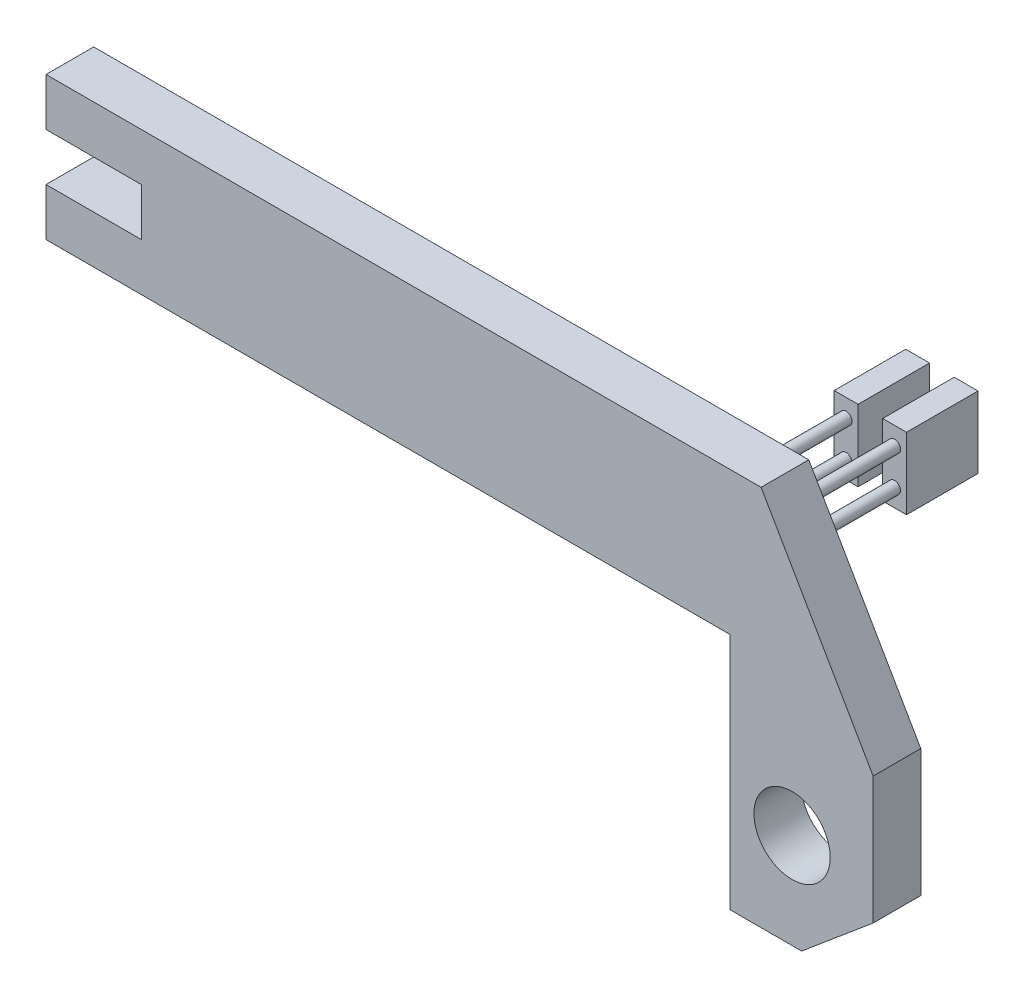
ISO-10303-21;
HEADER;
FILE_DESCRIPTION(('STEP AP214'),'2;1');
FILE_NAME('part.step','',(''),(''),'','','');
FILE_SCHEMA(('AUTOMOTIVE_DESIGN { 1 0 10303 214 1 1 1 1 }'));
ENDSEC;
DATA;
#1=APPLICATION_CONTEXT('core data for automotive mechanical design processes');
#2=APPLICATION_PROTOCOL_DEFINITION('international standard','automotive_design',2000,#1);
#3=PRODUCT_CONTEXT('',#1,'mechanical');
#4=PRODUCT('Part','Part','',(#3));
#5=PRODUCT_RELATED_PRODUCT_CATEGORY('part','',(#4));
#6=PRODUCT_DEFINITION_FORMATION('','',#4);
#7=PRODUCT_DEFINITION_CONTEXT('part definition',#1,'design');
#8=PRODUCT_DEFINITION('design','',#6,#7);
#9=PRODUCT_DEFINITION_SHAPE('','',#8);
#10=(LENGTH_UNIT() NAMED_UNIT(*) SI_UNIT(.MILLI.,.METRE.));
#11=(NAMED_UNIT(*) PLANE_ANGLE_UNIT() SI_UNIT($,.RADIAN.));
#12=(NAMED_UNIT(*) SI_UNIT($,.STERADIAN.) SOLID_ANGLE_UNIT());
#13=UNCERTAINTY_MEASURE_WITH_UNIT(LENGTH_MEASURE(1.E-05),#10,'distance_accuracy_value','');
#14=(GEOMETRIC_REPRESENTATION_CONTEXT(3) GLOBAL_UNCERTAINTY_ASSIGNED_CONTEXT((#13)) GLOBAL_UNIT_ASSIGNED_CONTEXT((#10,
#11,#12)) REPRESENTATION_CONTEXT('',''));
#15=CARTESIAN_POINT('',(0.,0.,0.));
#16=DIRECTION('',(0.,0.,1.));
#17=DIRECTION('',(1.,0.,0.));
#18=AXIS2_PLACEMENT_3D('',#15,#16,#17);
#19=CARTESIAN_POINT('',(0.,0.,0.));
#20=DIRECTION('',(0.,0.,1.));
#21=DIRECTION('',(1.,0.,0.));
#22=AXIS2_PLACEMENT_3D('',#19,#20,#21);
#23=PLANE('',#22);
#24=CARTESIAN_POINT('',(26.0676222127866,1.3,0.));
#25=DIRECTION('',(0.,0.,1.));
#26=DIRECTION('',(1.,0.,0.));
#27=AXIS2_PLACEMENT_3D('',#24,#25,#26);
#28=CIRCLE('',#27,0.25);
#29=CARTESIAN_POINT('',(26.3176222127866,1.3,0.));
#30=VERTEX_POINT('',#29);
#31=EDGE_CURVE('E44',#30,#30,#28,.F.);
#32=ORIENTED_EDGE('',*,*,#31,.F.);
#33=EDGE_LOOP('',(#32));
#34=FACE_BOUND('',#33,.T.);
#35=CARTESIAN_POINT('',(28.1,1.3,0.));
#36=DIRECTION('',(0.,0.,1.));
#37=DIRECTION('',(1.,0.,0.));
#38=AXIS2_PLACEMENT_3D('',#35,#36,#37);
#39=CIRCLE('',#38,0.25);
#40=CARTESIAN_POINT('',(28.35,1.3,0.));
#41=VERTEX_POINT('',#40);
#42=EDGE_CURVE('E212',#41,#41,#39,.F.);
#43=ORIENTED_EDGE('',*,*,#42,.F.);
#44=EDGE_LOOP('',(#43));
#45=FACE_BOUND('',#44,.T.);
#46=DIRECTION('',(0.,-1.,0.));
#47=VECTOR('',#46,1.);
#48=CARTESIAN_POINT('',(0.,2.,0.));
#49=LINE('',#48,#47);
#50=CARTESIAN_POINT('',(0.,2.,0.));
#51=VERTEX_POINT('',#50);
#52=CARTESIAN_POINT('',(0.,0.,0.));
#53=VERTEX_POINT('',#52);
#54=EDGE_CURVE('E162',#51,#53,#49,.T.);
#55=ORIENTED_EDGE('',*,*,#54,.F.);
#56=DIRECTION('',(-1.,0.,0.));
#57=VECTOR('',#56,1.);
#58=CARTESIAN_POINT('',(4.,2.,0.));
#59=LINE('',#58,#57);
#60=CARTESIAN_POINT('',(4.,2.,0.));
#61=VERTEX_POINT('',#60);
#62=EDGE_CURVE('E100',#61,#51,#59,.T.);
#63=ORIENTED_EDGE('',*,*,#62,.F.);
#64=DIRECTION('',(0.,-1.,0.));
#65=VECTOR('',#64,1.);
#66=CARTESIAN_POINT('',(4.,4.,0.));
#67=LINE('',#66,#65);
#68=CARTESIAN_POINT('',(4.,4.,0.));
#69=VERTEX_POINT('',#68);
#70=EDGE_CURVE('E94',#69,#61,#67,.T.);
#71=ORIENTED_EDGE('',*,*,#70,.F.);
#72=DIRECTION('',(1.,0.,0.));
#73=VECTOR('',#72,1.);
#74=CARTESIAN_POINT('',(0.,4.,0.));
#75=LINE('',#74,#73);
#76=CARTESIAN_POINT('',(0.,4.,0.));
#77=VERTEX_POINT('',#76);
#78=EDGE_CURVE('E152',#77,#69,#75,.T.);
#79=ORIENTED_EDGE('',*,*,#78,.F.);
#80=DIRECTION('',(0.,-1.,0.));
#81=VECTOR('',#80,1.);
#82=CARTESIAN_POINT('',(0.,6.,0.));
#83=LINE('',#82,#81);
#84=CARTESIAN_POINT('',(0.,6.,0.));
#85=VERTEX_POINT('',#84);
#86=EDGE_CURVE('E180',#85,#77,#83,.T.);
#87=ORIENTED_EDGE('',*,*,#86,.F.);
#88=DIRECTION('',(-1.,0.,0.));
#89=VECTOR('',#88,1.);
#90=CARTESIAN_POINT('',(30.,6.00000000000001,0.));
#91=LINE('',#90,#89);
#92=CARTESIAN_POINT('',(30.,6.00000000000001,0.));
#93=VERTEX_POINT('',#92);
#94=EDGE_CURVE('E178',#93,#85,#91,.T.);
#95=ORIENTED_EDGE('',*,*,#94,.F.);
#96=DIRECTION('',(-0.5,0.866025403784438,0.));
#97=VECTOR('',#96,1.);
#98=CARTESIAN_POINT('',(34.7,-2.14063879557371,0.));
#99=LINE('',#98,#97);
#100=CARTESIAN_POINT('',(34.7,-2.14063879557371,0.));
#101=VERTEX_POINT('',#100);
#102=EDGE_CURVE('E176',#101,#93,#99,.T.);
#103=ORIENTED_EDGE('',*,*,#102,.F.);
#104=DIRECTION('',(0.,1.,0.));
#105=VECTOR('',#104,1.);
#106=CARTESIAN_POINT('',(34.7,-7.48270110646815,0.));
#107=LINE('',#106,#105);
#108=CARTESIAN_POINT('',(34.7,-7.48270110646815,0.));
#109=VERTEX_POINT('',#108);
#110=EDGE_CURVE('E174',#109,#101,#107,.T.);
#111=ORIENTED_EDGE('',*,*,#110,.F.);
#112=DIRECTION('',(0.766044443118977,0.642787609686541,0.));
#113=VECTOR('',#112,1.);
#114=CARTESIAN_POINT('',(31.7,-10.,0.));
#115=LINE('',#114,#113);
#116=CARTESIAN_POINT('',(31.7,-10.,0.));
#117=VERTEX_POINT('',#116);
#118=EDGE_CURVE('E172',#117,#109,#115,.T.);
#119=ORIENTED_EDGE('',*,*,#118,.F.);
#120=DIRECTION('',(1.,0.,0.));
#121=VECTOR('',#120,1.);
#122=CARTESIAN_POINT('',(28.7,-10.,0.));
#123=LINE('',#122,#121);
#124=CARTESIAN_POINT('',(28.7,-10.,0.));
#125=VERTEX_POINT('',#124);
#126=EDGE_CURVE('E170',#125,#117,#123,.T.);
#127=ORIENTED_EDGE('',*,*,#126,.F.);
#128=DIRECTION('',(0.,-1.,0.));
#129=VECTOR('',#128,1.);
#130=CARTESIAN_POINT('',(28.7,0.,0.));
#131=LINE('',#130,#129);
#132=CARTESIAN_POINT('',(28.7,0.,0.));
#133=VERTEX_POINT('',#132);
#134=EDGE_CURVE('E168',#133,#125,#131,.T.);
#135=ORIENTED_EDGE('',*,*,#134,.F.);
#136=DIRECTION('',(1.,0.,0.));
#137=VECTOR('',#136,1.);
#138=CARTESIAN_POINT('',(0.,0.,0.));
#139=LINE('',#138,#137);
#140=EDGE_CURVE('E165',#53,#133,#139,.T.);
#141=ORIENTED_EDGE('',*,*,#140,.F.);
#142=EDGE_LOOP('',(#55,#63,#71,#79,#87,#95,#103,#111,#119,#127,#135,#141));
#143=FACE_BOUND('',#142,.T.);
#144=CARTESIAN_POINT('',(31.3,-6.,0.));
#145=DIRECTION('',(0.,0.,1.));
#146=DIRECTION('',(1.,0.,0.));
#147=AXIS2_PLACEMENT_3D('',#144,#145,#146);
#148=CIRCLE('',#147,1.6);
#149=CARTESIAN_POINT('',(32.9,-6.,0.));
#150=VERTEX_POINT('',#149);
#151=EDGE_CURVE('E232',#150,#150,#148,.T.);
#152=ORIENTED_EDGE('',*,*,#151,.T.);
#153=EDGE_LOOP('',(#152));
#154=FACE_BOUND('',#153,.T.);
#155=CARTESIAN_POINT('',(28.1,2.8,0.));
#156=DIRECTION('',(0.,0.,1.));
#157=DIRECTION('',(1.,0.,0.));
#158=AXIS2_PLACEMENT_3D('',#155,#156,#157);
#159=CIRCLE('',#158,0.25);
#160=CARTESIAN_POINT('',(28.35,2.8,0.));
#161=VERTEX_POINT('',#160);
#162=EDGE_CURVE('E215',#161,#161,#159,.F.);
#163=ORIENTED_EDGE('',*,*,#162,.F.);
#164=EDGE_LOOP('',(#163));
#165=FACE_BOUND('',#164,.T.);
#166=CARTESIAN_POINT('',(26.0676222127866,2.8,0.));
#167=DIRECTION('',(0.,0.,1.));
#168=DIRECTION('',(1.,0.,0.));
#169=AXIS2_PLACEMENT_3D('',#166,#167,#168);
#170=CIRCLE('',#169,0.25);
#171=CARTESIAN_POINT('',(26.3176222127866,2.8,0.));
#172=VERTEX_POINT('',#171);
#173=EDGE_CURVE('E11',#172,#172,#170,.F.);
#174=ORIENTED_EDGE('',*,*,#173,.F.);
#175=EDGE_LOOP('',(#174));
#176=FACE_BOUND('',#175,.T.);
#177=ADVANCED_FACE('F35',(#34,#45,#143,#154,#165,#176),#23,.F.);
#178=CARTESIAN_POINT('',(0.,0.,2.));
#179=DIRECTION('',(0.,0.,1.));
#180=DIRECTION('',(1.,0.,0.));
#181=AXIS2_PLACEMENT_3D('',#178,#179,#180);
#182=PLANE('',#181);
#183=DIRECTION('',(0.,-1.,0.));
#184=VECTOR('',#183,1.);
#185=CARTESIAN_POINT('',(0.,2.,2.));
#186=LINE('',#185,#184);
#187=CARTESIAN_POINT('',(0.,2.,2.));
#188=VERTEX_POINT('',#187);
#189=CARTESIAN_POINT('',(0.,0.,2.));
#190=VERTEX_POINT('',#189);
#191=EDGE_CURVE('E185',#188,#190,#186,.T.);
#192=ORIENTED_EDGE('',*,*,#191,.T.);
#193=DIRECTION('',(1.,0.,0.));
#194=VECTOR('',#193,1.);
#195=CARTESIAN_POINT('',(0.,0.,2.));
#196=LINE('',#195,#194);
#197=CARTESIAN_POINT('',(28.7,0.,2.));
#198=VERTEX_POINT('',#197);
#199=EDGE_CURVE('E109',#190,#198,#196,.T.);
#200=ORIENTED_EDGE('',*,*,#199,.T.);
#201=DIRECTION('',(0.,-1.,0.));
#202=VECTOR('',#201,1.);
#203=CARTESIAN_POINT('',(28.7,0.,2.));
#204=LINE('',#203,#202);
#205=CARTESIAN_POINT('',(28.7,-10.,2.));
#206=VERTEX_POINT('',#205);
#207=EDGE_CURVE('E313',#198,#206,#204,.T.);
#208=ORIENTED_EDGE('',*,*,#207,.T.);
#209=DIRECTION('',(1.,0.,0.));
#210=VECTOR('',#209,1.);
#211=CARTESIAN_POINT('',(28.7,-10.,2.));
#212=LINE('',#211,#210);
#213=CARTESIAN_POINT('',(31.7,-10.,2.));
#214=VERTEX_POINT('',#213);
#215=EDGE_CURVE('E324',#206,#214,#212,.T.);
#216=ORIENTED_EDGE('',*,*,#215,.T.);
#217=DIRECTION('',(0.766044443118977,0.642787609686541,0.));
#218=VECTOR('',#217,1.);
#219=CARTESIAN_POINT('',(31.7,-10.,2.));
#220=LINE('',#219,#218);
#221=CARTESIAN_POINT('',(34.7,-7.48270110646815,2.));
#222=VERTEX_POINT('',#221);
#223=EDGE_CURVE('E321',#214,#222,#220,.T.);
#224=ORIENTED_EDGE('',*,*,#223,.T.);
#225=DIRECTION('',(0.,1.,0.));
#226=VECTOR('',#225,1.);
#227=CARTESIAN_POINT('',(34.7,-7.48270110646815,2.));
#228=LINE('',#227,#226);
#229=CARTESIAN_POINT('',(34.7,-2.14063879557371,2.));
#230=VERTEX_POINT('',#229);
#231=EDGE_CURVE('E323',#222,#230,#228,.T.);
#232=ORIENTED_EDGE('',*,*,#231,.T.);
#233=DIRECTION('',(-0.5,0.866025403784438,0.));
#234=VECTOR('',#233,1.);
#235=CARTESIAN_POINT('',(34.7,-2.14063879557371,2.));
#236=LINE('',#235,#234);
#237=CARTESIAN_POINT('',(30.,6.00000000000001,2.));
#238=VERTEX_POINT('',#237);
#239=EDGE_CURVE('E326',#230,#238,#236,.T.);
#240=ORIENTED_EDGE('',*,*,#239,.T.);
#241=DIRECTION('',(-1.,0.,0.));
#242=VECTOR('',#241,1.);
#243=CARTESIAN_POINT('',(30.,6.00000000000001,2.));
#244=LINE('',#243,#242);
#245=CARTESIAN_POINT('',(0.,6.,2.));
#246=VERTEX_POINT('',#245);
#247=EDGE_CURVE('E332',#238,#246,#244,.T.);
#248=ORIENTED_EDGE('',*,*,#247,.T.);
#249=DIRECTION('',(0.,-1.,0.));
#250=VECTOR('',#249,1.);
#251=CARTESIAN_POINT('',(0.,6.,2.));
#252=LINE('',#251,#250);
#253=CARTESIAN_POINT('',(0.,4.,2.));
#254=VERTEX_POINT('',#253);
#255=EDGE_CURVE('E144',#246,#254,#252,.T.);
#256=ORIENTED_EDGE('',*,*,#255,.T.);
#257=DIRECTION('',(1.,0.,0.));
#258=VECTOR('',#257,1.);
#259=CARTESIAN_POINT('',(0.,4.,2.));
#260=LINE('',#259,#258);
#261=CARTESIAN_POINT('',(4.,4.,2.));
#262=VERTEX_POINT('',#261);
#263=EDGE_CURVE('E137',#254,#262,#260,.T.);
#264=ORIENTED_EDGE('',*,*,#263,.T.);
#265=DIRECTION('',(0.,-1.,0.));
#266=VECTOR('',#265,1.);
#267=CARTESIAN_POINT('',(4.,4.,2.));
#268=LINE('',#267,#266);
#269=CARTESIAN_POINT('',(4.,2.,2.));
#270=VERTEX_POINT('',#269);
#271=EDGE_CURVE('E142',#262,#270,#268,.T.);
#272=ORIENTED_EDGE('',*,*,#271,.T.);
#273=DIRECTION('',(-1.,0.,0.));
#274=VECTOR('',#273,1.);
#275=CARTESIAN_POINT('',(4.,2.,2.));
#276=LINE('',#275,#274);
#277=EDGE_CURVE('E52',#270,#188,#276,.T.);
#278=ORIENTED_EDGE('',*,*,#277,.T.);
#279=EDGE_LOOP('',(#192,#200,#208,#216,#224,#232,#240,#248,#256,#264,#272,#278));
#280=FACE_BOUND('',#279,.T.);
#281=CARTESIAN_POINT('',(31.3,-6.,2.));
#282=DIRECTION('',(0.,0.,1.));
#283=DIRECTION('',(1.,0.,0.));
#284=AXIS2_PLACEMENT_3D('',#281,#282,#283);
#285=CIRCLE('',#284,1.6);
#286=CARTESIAN_POINT('',(32.9,-6.,2.));
#287=VERTEX_POINT('',#286);
#288=EDGE_CURVE('E166',#287,#287,#285,.T.);
#289=ORIENTED_EDGE('',*,*,#288,.F.);
#290=EDGE_LOOP('',(#289));
#291=FACE_BOUND('',#290,.T.);
#292=ADVANCED_FACE('F139',(#280,#291),#182,.T.);
#293=CARTESIAN_POINT('',(0.,2.,2.));
#294=DIRECTION('',(1.,0.,0.));
#295=DIRECTION('',(0.,1.,0.));
#296=AXIS2_PLACEMENT_3D('',#293,#294,#295);
#297=PLANE('',#296);
#298=ORIENTED_EDGE('',*,*,#54,.T.);
#299=DIRECTION('',(0.,0.,-1.));
#300=VECTOR('',#299,1.);
#301=CARTESIAN_POINT('',(0.,0.,2.));
#302=LINE('',#301,#300);
#303=EDGE_CURVE('E210',#190,#53,#302,.T.);
#304=ORIENTED_EDGE('',*,*,#303,.F.);
#305=ORIENTED_EDGE('',*,*,#191,.F.);
#306=DIRECTION('',(0.,0.,-1.));
#307=VECTOR('',#306,1.);
#308=CARTESIAN_POINT('',(0.,2.,2.));
#309=LINE('',#308,#307);
#310=EDGE_CURVE('E158',#188,#51,#309,.T.);
#311=ORIENTED_EDGE('',*,*,#310,.T.);
#312=EDGE_LOOP('',(#298,#304,#305,#311));
#313=FACE_BOUND('',#312,.T.);
#314=ADVANCED_FACE('F37',(#313),#297,.F.);
#315=CARTESIAN_POINT('',(0.,0.,2.));
#316=DIRECTION('',(0.,1.,0.));
#317=DIRECTION('',(0.,0.,1.));
#318=AXIS2_PLACEMENT_3D('',#315,#316,#317);
#319=PLANE('',#318);
#320=ORIENTED_EDGE('',*,*,#140,.T.);
#321=DIRECTION('',(0.,0.,-1.));
#322=VECTOR('',#321,1.);
#323=CARTESIAN_POINT('',(28.7,0.,2.));
#324=LINE('',#323,#322);
#325=EDGE_CURVE('E207',#198,#133,#324,.T.);
#326=ORIENTED_EDGE('',*,*,#325,.F.);
#327=ORIENTED_EDGE('',*,*,#199,.F.);
#328=ORIENTED_EDGE('',*,*,#303,.T.);
#329=EDGE_LOOP('',(#320,#326,#327,#328));
#330=FACE_BOUND('',#329,.T.);
#331=ADVANCED_FACE('F302',(#330),#319,.F.);
#332=CARTESIAN_POINT('',(28.7,0.,2.));
#333=DIRECTION('',(1.,0.,0.));
#334=DIRECTION('',(0.,0.,-1.));
#335=AXIS2_PLACEMENT_3D('',#332,#333,#334);
#336=PLANE('',#335);
#337=ORIENTED_EDGE('',*,*,#134,.T.);
#338=DIRECTION('',(0.,0.,-1.));
#339=VECTOR('',#338,1.);
#340=CARTESIAN_POINT('',(28.7,-10.,2.));
#341=LINE('',#340,#339);
#342=EDGE_CURVE('E204',#206,#125,#341,.T.);
#343=ORIENTED_EDGE('',*,*,#342,.F.);
#344=ORIENTED_EDGE('',*,*,#207,.F.);
#345=ORIENTED_EDGE('',*,*,#325,.T.);
#346=EDGE_LOOP('',(#337,#343,#344,#345));
#347=FACE_BOUND('',#346,.T.);
#348=ADVANCED_FACE('F299',(#347),#336,.F.);
#349=CARTESIAN_POINT('',(28.7,-10.,2.));
#350=DIRECTION('',(0.,1.,0.));
#351=DIRECTION('',(0.,0.,1.));
#352=AXIS2_PLACEMENT_3D('',#349,#350,#351);
#353=PLANE('',#352);
#354=ORIENTED_EDGE('',*,*,#126,.T.);
#355=DIRECTION('',(0.,0.,-1.));
#356=VECTOR('',#355,1.);
#357=CARTESIAN_POINT('',(31.7,-10.,2.));
#358=LINE('',#357,#356);
#359=EDGE_CURVE('E201',#214,#117,#358,.T.);
#360=ORIENTED_EDGE('',*,*,#359,.F.);
#361=ORIENTED_EDGE('',*,*,#215,.F.);
#362=ORIENTED_EDGE('',*,*,#342,.T.);
#363=EDGE_LOOP('',(#354,#360,#361,#362));
#364=FACE_BOUND('',#363,.T.);
#365=ADVANCED_FACE('F295',(#364),#353,.F.);
#366=CARTESIAN_POINT('',(31.7,-10.,2.));
#367=DIRECTION('',(-0.642787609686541,0.766044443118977,0.));
#368=DIRECTION('',(-0.766044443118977,-0.642787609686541,0.));
#369=AXIS2_PLACEMENT_3D('',#366,#367,#368);
#370=PLANE('',#369);
#371=ORIENTED_EDGE('',*,*,#118,.T.);
#372=DIRECTION('',(0.,0.,-1.));
#373=VECTOR('',#372,1.);
#374=CARTESIAN_POINT('',(34.7,-7.48270110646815,2.));
#375=LINE('',#374,#373);
#376=EDGE_CURVE('E198',#222,#109,#375,.T.);
#377=ORIENTED_EDGE('',*,*,#376,.F.);
#378=ORIENTED_EDGE('',*,*,#223,.F.);
#379=ORIENTED_EDGE('',*,*,#359,.T.);
#380=EDGE_LOOP('',(#371,#377,#378,#379));
#381=FACE_BOUND('',#380,.T.);
#382=ADVANCED_FACE('F291',(#381),#370,.F.);
#383=CARTESIAN_POINT('',(34.7,-7.48270110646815,2.));
#384=DIRECTION('',(-1.,0.,0.));
#385=DIRECTION('',(0.,0.,1.));
#386=AXIS2_PLACEMENT_3D('',#383,#384,#385);
#387=PLANE('',#386);
#388=ORIENTED_EDGE('',*,*,#110,.T.);
#389=DIRECTION('',(0.,0.,-1.));
#390=VECTOR('',#389,1.);
#391=CARTESIAN_POINT('',(34.7,-2.14063879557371,2.));
#392=LINE('',#391,#390);
#393=EDGE_CURVE('E195',#230,#101,#392,.T.);
#394=ORIENTED_EDGE('',*,*,#393,.F.);
#395=ORIENTED_EDGE('',*,*,#231,.F.);
#396=ORIENTED_EDGE('',*,*,#376,.T.);
#397=EDGE_LOOP('',(#388,#394,#395,#396));
#398=FACE_BOUND('',#397,.T.);
#399=ADVANCED_FACE('F287',(#398),#387,.F.);
#400=CARTESIAN_POINT('',(34.7,-2.14063879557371,2.));
#401=DIRECTION('',(-0.866025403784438,-0.5,0.));
#402=DIRECTION('',(0.5,-0.866025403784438,0.));
#403=AXIS2_PLACEMENT_3D('',#400,#401,#402);
#404=PLANE('',#403);
#405=ORIENTED_EDGE('',*,*,#102,.T.);
#406=DIRECTION('',(0.,0.,-1.));
#407=VECTOR('',#406,1.);
#408=CARTESIAN_POINT('',(30.,6.00000000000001,2.));
#409=LINE('',#408,#407);
#410=EDGE_CURVE('E192',#238,#93,#409,.T.);
#411=ORIENTED_EDGE('',*,*,#410,.F.);
#412=ORIENTED_EDGE('',*,*,#239,.F.);
#413=ORIENTED_EDGE('',*,*,#393,.T.);
#414=EDGE_LOOP('',(#405,#411,#412,#413));
#415=FACE_BOUND('',#414,.T.);
#416=ADVANCED_FACE('F283',(#415),#404,.F.);
#417=CARTESIAN_POINT('',(30.,6.00000000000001,2.));
#418=DIRECTION('',(0.,-1.,0.));
#419=DIRECTION('',(1.,0.,0.));
#420=AXIS2_PLACEMENT_3D('',#417,#418,#419);
#421=PLANE('',#420);
#422=ORIENTED_EDGE('',*,*,#94,.T.);
#423=DIRECTION('',(0.,0.,-1.));
#424=VECTOR('',#423,1.);
#425=CARTESIAN_POINT('',(0.,6.,2.));
#426=LINE('',#425,#424);
#427=EDGE_CURVE('E189',#246,#85,#426,.T.);
#428=ORIENTED_EDGE('',*,*,#427,.F.);
#429=ORIENTED_EDGE('',*,*,#247,.F.);
#430=ORIENTED_EDGE('',*,*,#410,.T.);
#431=EDGE_LOOP('',(#422,#428,#429,#430));
#432=FACE_BOUND('',#431,.T.);
#433=ADVANCED_FACE('F279',(#432),#421,.F.);
#434=CARTESIAN_POINT('',(0.,6.,2.));
#435=DIRECTION('',(1.,0.,0.));
#436=DIRECTION('',(0.,1.,0.));
#437=AXIS2_PLACEMENT_3D('',#434,#435,#436);
#438=PLANE('',#437);
#439=ORIENTED_EDGE('',*,*,#86,.T.);
#440=DIRECTION('',(0.,0.,-1.));
#441=VECTOR('',#440,1.);
#442=CARTESIAN_POINT('',(0.,4.,2.));
#443=LINE('',#442,#441);
#444=EDGE_CURVE('E153',#254,#77,#443,.T.);
#445=ORIENTED_EDGE('',*,*,#444,.F.);
#446=ORIENTED_EDGE('',*,*,#255,.F.);
#447=ORIENTED_EDGE('',*,*,#427,.T.);
#448=EDGE_LOOP('',(#439,#445,#446,#447));
#449=FACE_BOUND('',#448,.T.);
#450=ADVANCED_FACE('F276',(#449),#438,.F.);
#451=CARTESIAN_POINT('',(0.,4.,2.));
#452=DIRECTION('',(0.,1.,0.));
#453=DIRECTION('',(0.,0.,1.));
#454=AXIS2_PLACEMENT_3D('',#451,#452,#453);
#455=PLANE('',#454);
#456=ORIENTED_EDGE('',*,*,#78,.T.);
#457=DIRECTION('',(0.,0.,-1.));
#458=VECTOR('',#457,1.);
#459=CARTESIAN_POINT('',(4.,4.,2.));
#460=LINE('',#459,#458);
#461=EDGE_CURVE('E149',#262,#69,#460,.T.);
#462=ORIENTED_EDGE('',*,*,#461,.F.);
#463=ORIENTED_EDGE('',*,*,#263,.F.);
#464=ORIENTED_EDGE('',*,*,#444,.T.);
#465=EDGE_LOOP('',(#456,#462,#463,#464));
#466=FACE_BOUND('',#465,.T.);
#467=ADVANCED_FACE('F150',(#466),#455,.F.);
#468=CARTESIAN_POINT('',(4.,4.,2.));
#469=DIRECTION('',(1.,0.,0.));
#470=DIRECTION('',(0.,1.,0.));
#471=AXIS2_PLACEMENT_3D('',#468,#469,#470);
#472=PLANE('',#471);
#473=ORIENTED_EDGE('',*,*,#70,.T.);
#474=DIRECTION('',(0.,0.,-1.));
#475=VECTOR('',#474,1.);
#476=CARTESIAN_POINT('',(4.,2.,2.));
#477=LINE('',#476,#475);
#478=EDGE_CURVE('E154',#270,#61,#477,.T.);
#479=ORIENTED_EDGE('',*,*,#478,.F.);
#480=ORIENTED_EDGE('',*,*,#271,.F.);
#481=ORIENTED_EDGE('',*,*,#461,.T.);
#482=EDGE_LOOP('',(#473,#479,#480,#481));
#483=FACE_BOUND('',#482,.T.);
#484=ADVANCED_FACE('F156',(#483),#472,.F.);
#485=CARTESIAN_POINT('',(4.,2.,2.));
#486=DIRECTION('',(0.,-1.,0.));
#487=DIRECTION('',(0.,0.,-1.));
#488=AXIS2_PLACEMENT_3D('',#485,#486,#487);
#489=PLANE('',#488);
#490=ORIENTED_EDGE('',*,*,#62,.T.);
#491=ORIENTED_EDGE('',*,*,#310,.F.);
#492=ORIENTED_EDGE('',*,*,#277,.F.);
#493=ORIENTED_EDGE('',*,*,#478,.T.);
#494=EDGE_LOOP('',(#490,#491,#492,#493));
#495=FACE_BOUND('',#494,.T.);
#496=ADVANCED_FACE('F266',(#495),#489,.F.);
#497=CARTESIAN_POINT('',(31.3,-6.,2.));
#498=DIRECTION('',(0.,0.,-1.));
#499=DIRECTION('',(-1.,0.,0.));
#500=AXIS2_PLACEMENT_3D('',#497,#498,#499);
#501=CYLINDRICAL_SURFACE('',#500,1.6);
#502=ORIENTED_EDGE('',*,*,#288,.T.);
#503=EDGE_LOOP('',(#502));
#504=FACE_BOUND('',#503,.T.);
#505=ORIENTED_EDGE('',*,*,#151,.F.);
#506=EDGE_LOOP('',(#505));
#507=FACE_BOUND('',#506,.T.);
#508=ADVANCED_FACE('F262',(#504,#507),#501,.F.);
#509=CARTESIAN_POINT('',(28.1,1.3,-5.5));
#510=DIRECTION('',(0.,0.,1.));
#511=DIRECTION('',(1.,0.,0.));
#512=AXIS2_PLACEMENT_3D('',#509,#510,#511);
#513=CYLINDRICAL_SURFACE('',#512,0.25);
#514=CARTESIAN_POINT('',(28.1,1.3,-5.5));
#515=DIRECTION('',(0.,0.,-1.));
#516=DIRECTION('',(-1.,0.,0.));
#517=AXIS2_PLACEMENT_3D('',#514,#515,#516);
#518=CIRCLE('',#517,0.25);
#519=CARTESIAN_POINT('',(27.85,1.3,-5.5));
#520=VERTEX_POINT('',#519);
#521=EDGE_CURVE('E345',#520,#520,#518,.T.);
#522=ORIENTED_EDGE('',*,*,#521,.F.);
#523=EDGE_LOOP('',(#522));
#524=FACE_BOUND('',#523,.T.);
#525=ORIENTED_EDGE('',*,*,#42,.T.);
#526=EDGE_LOOP('',(#525));
#527=FACE_BOUND('',#526,.T.);
#528=ADVANCED_FACE('F258',(#524,#527),#513,.T.);
#529=CARTESIAN_POINT('',(28.1,2.8,-5.5));
#530=DIRECTION('',(0.,0.,1.));
#531=DIRECTION('',(1.,0.,0.));
#532=AXIS2_PLACEMENT_3D('',#529,#530,#531);
#533=CYLINDRICAL_SURFACE('',#532,0.25);
#534=CARTESIAN_POINT('',(28.1,2.8,-5.5));
#535=DIRECTION('',(0.,0.,-1.));
#536=DIRECTION('',(-1.,0.,0.));
#537=AXIS2_PLACEMENT_3D('',#534,#535,#536);
#538=CIRCLE('',#537,0.25);
#539=CARTESIAN_POINT('',(27.85,2.8,-5.5));
#540=VERTEX_POINT('',#539);
#541=EDGE_CURVE('E350',#540,#540,#538,.T.);
#542=ORIENTED_EDGE('',*,*,#541,.F.);
#543=EDGE_LOOP('',(#542));
#544=FACE_BOUND('',#543,.T.);
#545=ORIENTED_EDGE('',*,*,#162,.T.);
#546=EDGE_LOOP('',(#545));
#547=FACE_BOUND('',#546,.T.);
#548=ADVANCED_FACE('F249',(#544,#547),#533,.T.);
#549=CARTESIAN_POINT('',(26.0676222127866,1.3,-5.5));
#550=DIRECTION('',(0.,0.,1.));
#551=DIRECTION('',(1.,0.,0.));
#552=AXIS2_PLACEMENT_3D('',#549,#550,#551);
#553=CYLINDRICAL_SURFACE('',#552,0.25);
#554=CARTESIAN_POINT('',(26.0676222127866,1.3,-5.5));
#555=DIRECTION('',(0.,0.,-1.));
#556=DIRECTION('',(-1.,0.,0.));
#557=AXIS2_PLACEMENT_3D('',#554,#555,#556);
#558=CIRCLE('',#557,0.25);
#559=CARTESIAN_POINT('',(25.8176222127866,1.3,-5.5));
#560=VERTEX_POINT('',#559);
#561=EDGE_CURVE('E353',#560,#560,#558,.T.);
#562=ORIENTED_EDGE('',*,*,#561,.F.);
#563=EDGE_LOOP('',(#562));
#564=FACE_BOUND('',#563,.T.);
#565=ORIENTED_EDGE('',*,*,#31,.T.);
#566=EDGE_LOOP('',(#565));
#567=FACE_BOUND('',#566,.T.);
#568=ADVANCED_FACE('F220',(#564,#567),#553,.T.);
#569=CARTESIAN_POINT('',(26.0676222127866,2.8,-5.5));
#570=DIRECTION('',(0.,0.,1.));
#571=DIRECTION('',(1.,0.,0.));
#572=AXIS2_PLACEMENT_3D('',#569,#570,#571);
#573=CYLINDRICAL_SURFACE('',#572,0.25);
#574=CARTESIAN_POINT('',(26.0676222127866,2.8,-5.5));
#575=DIRECTION('',(0.,0.,-1.));
#576=DIRECTION('',(-1.,0.,0.));
#577=AXIS2_PLACEMENT_3D('',#574,#575,#576);
#578=CIRCLE('',#577,0.25);
#579=CARTESIAN_POINT('',(25.8176222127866,2.8,-5.5));
#580=VERTEX_POINT('',#579);
#581=EDGE_CURVE('E356',#580,#580,#578,.T.);
#582=ORIENTED_EDGE('',*,*,#581,.F.);
#583=EDGE_LOOP('',(#582));
#584=FACE_BOUND('',#583,.T.);
#585=ORIENTED_EDGE('',*,*,#173,.T.);
#586=EDGE_LOOP('',(#585));
#587=FACE_BOUND('',#586,.T.);
#588=ADVANCED_FACE('F237',(#584,#587),#573,.T.);
#589=CARTESIAN_POINT('',(27.6,0.55,-5.5));
#590=DIRECTION('',(0.,0.,1.));
#591=DIRECTION('',(1.,0.,0.));
#592=AXIS2_PLACEMENT_3D('',#589,#590,#591);
#593=PLANE('',#592);
#594=ORIENTED_EDGE('',*,*,#541,.T.);
#595=EDGE_LOOP('',(#594));
#596=FACE_BOUND('',#595,.T.);
#597=DIRECTION('',(0.,1.,0.));
#598=VECTOR('',#597,1.);
#599=CARTESIAN_POINT('',(27.6,3.55,-5.5));
#600=LINE('',#599,#598);
#601=CARTESIAN_POINT('',(27.6,0.55,-5.5));
#602=VERTEX_POINT('',#601);
#603=CARTESIAN_POINT('',(27.6,3.55,-5.5));
#604=VERTEX_POINT('',#603);
#605=EDGE_CURVE('E382',#602,#604,#600,.T.);
#606=ORIENTED_EDGE('',*,*,#605,.F.);
#607=DIRECTION('',(-1.,0.,0.));
#608=VECTOR('',#607,1.);
#609=CARTESIAN_POINT('',(27.6,0.55,-5.5));
#610=LINE('',#609,#608);
#611=CARTESIAN_POINT('',(28.6,0.55,-5.5));
#612=VERTEX_POINT('',#611);
#613=EDGE_CURVE('E372',#612,#602,#610,.T.);
#614=ORIENTED_EDGE('',*,*,#613,.F.);
#615=DIRECTION('',(0.,-1.,0.));
#616=VECTOR('',#615,1.);
#617=CARTESIAN_POINT('',(28.6,3.55,-5.5));
#618=LINE('',#617,#616);
#619=CARTESIAN_POINT('',(28.6,3.55,-5.5));
#620=VERTEX_POINT('',#619);
#621=EDGE_CURVE('E376',#620,#612,#618,.T.);
#622=ORIENTED_EDGE('',*,*,#621,.F.);
#623=DIRECTION('',(1.,0.,0.));
#624=VECTOR('',#623,1.);
#625=CARTESIAN_POINT('',(27.6,3.55,-5.5));
#626=LINE('',#625,#624);
#627=EDGE_CURVE('E379',#604,#620,#626,.T.);
#628=ORIENTED_EDGE('',*,*,#627,.F.);
#629=EDGE_LOOP('',(#606,#614,#622,#628));
#630=FACE_BOUND('',#629,.T.);
#631=ORIENTED_EDGE('',*,*,#521,.T.);
#632=EDGE_LOOP('',(#631));
#633=FACE_BOUND('',#632,.T.);
#634=ADVANCED_FACE('F239',(#596,#630,#633),#593,.T.);
#635=CARTESIAN_POINT('',(27.6,3.55,-8.5));
#636=DIRECTION('',(1.,0.,0.));
#637=DIRECTION('',(0.,0.,-1.));
#638=AXIS2_PLACEMENT_3D('',#635,#636,#637);
#639=PLANE('',#638);
#640=ORIENTED_EDGE('',*,*,#605,.T.);
#641=DIRECTION('',(0.,0.,1.));
#642=VECTOR('',#641,1.);
#643=CARTESIAN_POINT('',(27.6,3.55,-8.5));
#644=LINE('',#643,#642);
#645=CARTESIAN_POINT('',(27.6,3.55,-8.5));
#646=VERTEX_POINT('',#645);
#647=EDGE_CURVE('E359',#646,#604,#644,.T.);
#648=ORIENTED_EDGE('',*,*,#647,.F.);
#649=DIRECTION('',(0.,1.,0.));
#650=VECTOR('',#649,1.);
#651=CARTESIAN_POINT('',(27.6,3.55,-8.5));
#652=LINE('',#651,#650);
#653=CARTESIAN_POINT('',(27.6,0.55,-8.5));
#654=VERTEX_POINT('',#653);
#655=EDGE_CURVE('E375',#654,#646,#652,.T.);
#656=ORIENTED_EDGE('',*,*,#655,.F.);
#657=DIRECTION('',(0.,0.,1.));
#658=VECTOR('',#657,1.);
#659=CARTESIAN_POINT('',(27.6,0.55,-8.5));
#660=LINE('',#659,#658);
#661=EDGE_CURVE('E368',#654,#602,#660,.T.);
#662=ORIENTED_EDGE('',*,*,#661,.T.);
#663=EDGE_LOOP('',(#640,#648,#656,#662));
#664=FACE_BOUND('',#663,.T.);
#665=ADVANCED_FACE('F246',(#664),#639,.F.);
#666=CARTESIAN_POINT('',(27.6,3.55,-8.5));
#667=DIRECTION('',(0.,-1.,0.));
#668=DIRECTION('',(1.,0.,0.));
#669=AXIS2_PLACEMENT_3D('',#666,#667,#668);
#670=PLANE('',#669);
#671=ORIENTED_EDGE('',*,*,#627,.T.);
#672=DIRECTION('',(0.,0.,1.));
#673=VECTOR('',#672,1.);
#674=CARTESIAN_POINT('',(28.6,3.55,-8.5));
#675=LINE('',#674,#673);
#676=CARTESIAN_POINT('',(28.6,3.55,-8.5));
#677=VERTEX_POINT('',#676);
#678=EDGE_CURVE('E362',#677,#620,#675,.T.);
#679=ORIENTED_EDGE('',*,*,#678,.F.);
#680=DIRECTION('',(1.,0.,0.));
#681=VECTOR('',#680,1.);
#682=CARTESIAN_POINT('',(27.6,3.55,-8.5));
#683=LINE('',#682,#681);
#684=EDGE_CURVE('E391',#646,#677,#683,.T.);
#685=ORIENTED_EDGE('',*,*,#684,.F.);
#686=ORIENTED_EDGE('',*,*,#647,.T.);
#687=EDGE_LOOP('',(#671,#679,#685,#686));
#688=FACE_BOUND('',#687,.T.);
#689=ADVANCED_FACE('F490',(#688),#670,.F.);
#690=CARTESIAN_POINT('',(28.6,3.55,-8.5));
#691=DIRECTION('',(-1.,0.,0.));
#692=DIRECTION('',(0.,0.,1.));
#693=AXIS2_PLACEMENT_3D('',#690,#691,#692);
#694=PLANE('',#693);
#695=ORIENTED_EDGE('',*,*,#621,.T.);
#696=DIRECTION('',(0.,0.,1.));
#697=VECTOR('',#696,1.);
#698=CARTESIAN_POINT('',(28.6,0.55,-8.5));
#699=LINE('',#698,#697);
#700=CARTESIAN_POINT('',(28.6,0.55,-8.5));
#701=VERTEX_POINT('',#700);
#702=EDGE_CURVE('E365',#701,#612,#699,.T.);
#703=ORIENTED_EDGE('',*,*,#702,.F.);
#704=DIRECTION('',(0.,-1.,0.));
#705=VECTOR('',#704,1.);
#706=CARTESIAN_POINT('',(28.6,3.55,-8.5));
#707=LINE('',#706,#705);
#708=EDGE_CURVE('E388',#677,#701,#707,.T.);
#709=ORIENTED_EDGE('',*,*,#708,.F.);
#710=ORIENTED_EDGE('',*,*,#678,.T.);
#711=EDGE_LOOP('',(#695,#703,#709,#710));
#712=FACE_BOUND('',#711,.T.);
#713=ADVANCED_FACE('F494',(#712),#694,.F.);
#714=CARTESIAN_POINT('',(27.6,0.55,-8.5));
#715=DIRECTION('',(0.,1.,0.));
#716=DIRECTION('',(-1.,0.,0.));
#717=AXIS2_PLACEMENT_3D('',#714,#715,#716);
#718=PLANE('',#717);
#719=ORIENTED_EDGE('',*,*,#613,.T.);
#720=ORIENTED_EDGE('',*,*,#661,.F.);
#721=DIRECTION('',(-1.,0.,0.));
#722=VECTOR('',#721,1.);
#723=CARTESIAN_POINT('',(27.6,0.55,-8.5));
#724=LINE('',#723,#722);
#725=EDGE_CURVE('E371',#701,#654,#724,.T.);
#726=ORIENTED_EDGE('',*,*,#725,.F.);
#727=ORIENTED_EDGE('',*,*,#702,.T.);
#728=EDGE_LOOP('',(#719,#720,#726,#727));
#729=FACE_BOUND('',#728,.T.);
#730=ADVANCED_FACE('F480',(#729),#718,.F.);
#731=CARTESIAN_POINT('',(27.6,0.55,-8.5));
#732=DIRECTION('',(0.,0.,1.));
#733=DIRECTION('',(1.,0.,0.));
#734=AXIS2_PLACEMENT_3D('',#731,#732,#733);
#735=PLANE('',#734);
#736=ORIENTED_EDGE('',*,*,#655,.T.);
#737=ORIENTED_EDGE('',*,*,#684,.T.);
#738=ORIENTED_EDGE('',*,*,#708,.T.);
#739=ORIENTED_EDGE('',*,*,#725,.T.);
#740=EDGE_LOOP('',(#736,#737,#738,#739));
#741=FACE_BOUND('',#740,.T.);
#742=ADVANCED_FACE('F493',(#741),#735,.F.);
#743=CARTESIAN_POINT('',(25.5676222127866,3.55,-5.5));
#744=DIRECTION('',(0.,0.,-1.));
#745=DIRECTION('',(-1.,0.,0.));
#746=AXIS2_PLACEMENT_3D('',#743,#744,#745);
#747=PLANE('',#746);
#748=ORIENTED_EDGE('',*,*,#581,.T.);
#749=EDGE_LOOP('',(#748));
#750=FACE_BOUND('',#749,.T.);
#751=DIRECTION('',(0.,1.,0.));
#752=VECTOR('',#751,1.);
#753=CARTESIAN_POINT('',(25.5676222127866,0.55,-5.5));
#754=LINE('',#753,#752);
#755=CARTESIAN_POINT('',(25.5676222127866,0.55,-5.5));
#756=VERTEX_POINT('',#755);
#757=CARTESIAN_POINT('',(25.5676222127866,3.55,-5.5));
#758=VERTEX_POINT('',#757);
#759=EDGE_CURVE('E418',#756,#758,#754,.T.);
#760=ORIENTED_EDGE('',*,*,#759,.F.);
#761=DIRECTION('',(-1.,0.,0.));
#762=VECTOR('',#761,1.);
#763=CARTESIAN_POINT('',(25.5676222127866,0.55,-5.5));
#764=LINE('',#763,#762);
#765=CARTESIAN_POINT('',(26.5676222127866,0.549999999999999,-5.5));
#766=VERTEX_POINT('',#765);
#767=EDGE_CURVE('E408',#766,#756,#764,.T.);
#768=ORIENTED_EDGE('',*,*,#767,.F.);
#769=DIRECTION('',(0.,-1.,0.));
#770=VECTOR('',#769,1.);
#771=CARTESIAN_POINT('',(26.5676222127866,0.549999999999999,-5.5));
#772=LINE('',#771,#770);
#773=CARTESIAN_POINT('',(26.5676222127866,3.55,-5.5));
#774=VERTEX_POINT('',#773);
#775=EDGE_CURVE('E412',#774,#766,#772,.T.);
#776=ORIENTED_EDGE('',*,*,#775,.F.);
#777=DIRECTION('',(1.,0.,0.));
#778=VECTOR('',#777,1.);
#779=CARTESIAN_POINT('',(25.5676222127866,3.55,-5.5));
#780=LINE('',#779,#778);
#781=EDGE_CURVE('E415',#758,#774,#780,.T.);
#782=ORIENTED_EDGE('',*,*,#781,.F.);
#783=EDGE_LOOP('',(#760,#768,#776,#782));
#784=FACE_BOUND('',#783,.T.);
#785=ORIENTED_EDGE('',*,*,#561,.T.);
#786=EDGE_LOOP('',(#785));
#787=FACE_BOUND('',#786,.T.);
#788=ADVANCED_FACE('F505',(#750,#784,#787),#747,.F.);
#789=CARTESIAN_POINT('',(25.5676222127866,0.55,-8.5));
#790=DIRECTION('',(1.,0.,0.));
#791=DIRECTION('',(0.,0.,-1.));
#792=AXIS2_PLACEMENT_3D('',#789,#790,#791);
#793=PLANE('',#792);
#794=ORIENTED_EDGE('',*,*,#759,.T.);
#795=DIRECTION('',(0.,0.,1.));
#796=VECTOR('',#795,1.);
#797=CARTESIAN_POINT('',(25.5676222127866,3.55,-8.5));
#798=LINE('',#797,#796);
#799=CARTESIAN_POINT('',(25.5676222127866,3.55,-8.5));
#800=VERTEX_POINT('',#799);
#801=EDGE_CURVE('E385',#800,#758,#798,.T.);
#802=ORIENTED_EDGE('',*,*,#801,.F.);
#803=DIRECTION('',(0.,1.,0.));
#804=VECTOR('',#803,1.);
#805=CARTESIAN_POINT('',(25.5676222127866,0.55,-8.5));
#806=LINE('',#805,#804);
#807=CARTESIAN_POINT('',(25.5676222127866,0.55,-8.5));
#808=VERTEX_POINT('',#807);
#809=EDGE_CURVE('E411',#808,#800,#806,.T.);
#810=ORIENTED_EDGE('',*,*,#809,.F.);
#811=DIRECTION('',(0.,0.,1.));
#812=VECTOR('',#811,1.);
#813=CARTESIAN_POINT('',(25.5676222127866,0.55,-8.5));
#814=LINE('',#813,#812);
#815=EDGE_CURVE('E404',#808,#756,#814,.T.);
#816=ORIENTED_EDGE('',*,*,#815,.T.);
#817=EDGE_LOOP('',(#794,#802,#810,#816));
#818=FACE_BOUND('',#817,.T.);
#819=ADVANCED_FACE('F444',(#818),#793,.F.);
#820=CARTESIAN_POINT('',(25.5676222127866,3.55,-8.5));
#821=DIRECTION('',(0.,-1.,0.));
#822=DIRECTION('',(1.,0.,0.));
#823=AXIS2_PLACEMENT_3D('',#820,#821,#822);
#824=PLANE('',#823);
#825=ORIENTED_EDGE('',*,*,#781,.T.);
#826=DIRECTION('',(0.,0.,1.));
#827=VECTOR('',#826,1.);
#828=CARTESIAN_POINT('',(26.5676222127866,3.55,-8.5));
#829=LINE('',#828,#827);
#830=CARTESIAN_POINT('',(26.5676222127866,3.55,-8.5));
#831=VERTEX_POINT('',#830);
#832=EDGE_CURVE('E398',#831,#774,#829,.T.);
#833=ORIENTED_EDGE('',*,*,#832,.F.);
#834=DIRECTION('',(1.,0.,0.));
#835=VECTOR('',#834,1.);
#836=CARTESIAN_POINT('',(25.5676222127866,3.55,-8.5));
#837=LINE('',#836,#835);
#838=EDGE_CURVE('E426',#800,#831,#837,.T.);
#839=ORIENTED_EDGE('',*,*,#838,.F.);
#840=ORIENTED_EDGE('',*,*,#801,.T.);
#841=EDGE_LOOP('',(#825,#833,#839,#840));
#842=FACE_BOUND('',#841,.T.);
#843=ADVANCED_FACE('F448',(#842),#824,.F.);
#844=CARTESIAN_POINT('',(26.5676222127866,0.549999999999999,-8.5));
#845=DIRECTION('',(-1.,0.,0.));
#846=DIRECTION('',(0.,0.,1.));
#847=AXIS2_PLACEMENT_3D('',#844,#845,#846);
#848=PLANE('',#847);
#849=ORIENTED_EDGE('',*,*,#775,.T.);
#850=DIRECTION('',(0.,0.,1.));
#851=VECTOR('',#850,1.);
#852=CARTESIAN_POINT('',(26.5676222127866,0.549999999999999,-8.5));
#853=LINE('',#852,#851);
#854=CARTESIAN_POINT('',(26.5676222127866,0.549999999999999,-8.5));
#855=VERTEX_POINT('',#854);
#856=EDGE_CURVE('E401',#855,#766,#853,.T.);
#857=ORIENTED_EDGE('',*,*,#856,.F.);
#858=DIRECTION('',(0.,-1.,0.));
#859=VECTOR('',#858,1.);
#860=CARTESIAN_POINT('',(26.5676222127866,0.549999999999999,-8.5));
#861=LINE('',#860,#859);
#862=EDGE_CURVE('E423',#831,#855,#861,.T.);
#863=ORIENTED_EDGE('',*,*,#862,.F.);
#864=ORIENTED_EDGE('',*,*,#832,.T.);
#865=EDGE_LOOP('',(#849,#857,#863,#864));
#866=FACE_BOUND('',#865,.T.);
#867=ADVANCED_FACE('F510',(#866),#848,.F.);
#868=CARTESIAN_POINT('',(25.5676222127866,0.55,-8.5));
#869=DIRECTION('',(0.,1.,0.));
#870=DIRECTION('',(-1.,0.,0.));
#871=AXIS2_PLACEMENT_3D('',#868,#869,#870);
#872=PLANE('',#871);
#873=ORIENTED_EDGE('',*,*,#767,.T.);
#874=ORIENTED_EDGE('',*,*,#815,.F.);
#875=DIRECTION('',(-1.,0.,0.));
#876=VECTOR('',#875,1.);
#877=CARTESIAN_POINT('',(25.5676222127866,0.55,-8.5));
#878=LINE('',#877,#876);
#879=EDGE_CURVE('E407',#855,#808,#878,.T.);
#880=ORIENTED_EDGE('',*,*,#879,.F.);
#881=ORIENTED_EDGE('',*,*,#856,.T.);
#882=EDGE_LOOP('',(#873,#874,#880,#881));
#883=FACE_BOUND('',#882,.T.);
#884=ADVANCED_FACE('F513',(#883),#872,.F.);
#885=CARTESIAN_POINT('',(25.5676222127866,3.55,-8.5));
#886=DIRECTION('',(0.,0.,-1.));
#887=DIRECTION('',(-1.,0.,0.));
#888=AXIS2_PLACEMENT_3D('',#885,#886,#887);
#889=PLANE('',#888);
#890=ORIENTED_EDGE('',*,*,#809,.T.);
#891=ORIENTED_EDGE('',*,*,#838,.T.);
#892=ORIENTED_EDGE('',*,*,#862,.T.);
#893=ORIENTED_EDGE('',*,*,#879,.T.);
#894=EDGE_LOOP('',(#890,#891,#892,#893));
#895=FACE_BOUND('',#894,.T.);
#896=ADVANCED_FACE('F434',(#895),#889,.T.);
#897=CLOSED_SHELL('',(#177,#292,#314,#331,#348,#365,#382,#399,#416,#433,#450,#467,#484,#496,
#508,#528,#548,#568,#588,#634,#665,#689,#713,#730,#742,#788,#819,#843,#867,#884,#896));
#898=MANIFOLD_SOLID_BREP('B2',#897);
#899=ADVANCED_BREP_SHAPE_REPRESENTATION('',(#18,#898),#14);
#900=SHAPE_DEFINITION_REPRESENTATION(#9,#899);
ENDSEC;
END-ISO-10303-21;
